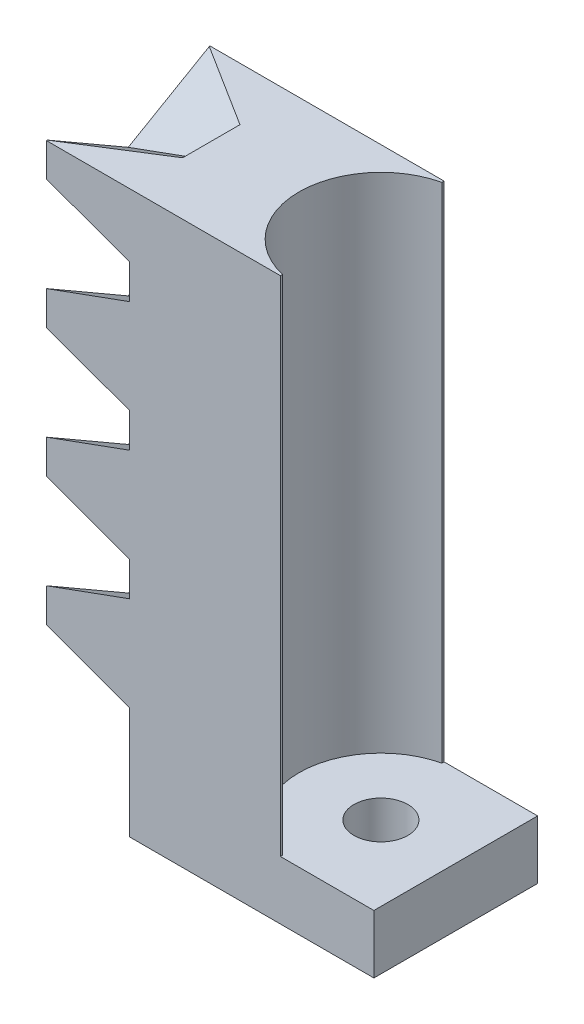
from build123d import *

# Parameters (mm, degrees)
SKETCH5_W           = 10
SKETCH5_H           = 24
BOSS_EXTRUDE2_DEPTH = 3.5
LPATTERN1_COUNT     = 5
LPATTERN1_PITCH     = 5.5
CUT_EXTRUDE1_DEPTH  = 7
SKETCH15_W          = 7
SKETCH15_H          = 2.5
BOSS_EXTRUDE3_DEPTH = 4
SKETCH16_R          = 1.15
CUT_EXTRUDE2_DEPTH  = 25.966778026
SKETCH16_3_R        = 3.5
SKETCH16_3_R_2      = 1.15
CUT_EXTRUDE3_DEPTH  = 25.966778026


with BuildPart() as part:
    # Sketch5 → Boss-Extrude2 (new, symmetric)
    with BuildSketch(Plane.XY):
        with Locations((3.2, 4.4726196)):
            Rectangle(SKETCH5_W, SKETCH5_H)
    extrude(amount=BOSS_EXTRUDE2_DEPTH, both=True)

    # Sketch9 → Cut-Loft1 section 0
    with BuildSketch(Plane.XY):
        with BuildLine():
            Line((-1.8, -7.5273804), (1.75, -6.235286))
            Line((1.75, -6.235286), (1.75, -4.7602883))
            Line((1.75, -4.7602883), (-1.8, -3.4681939))
            Line((-1.8, -3.4681939), (-1.8, -7.5273804))
        make_face()
    # Sketch11 → Cut-Loft1 section 1
    with BuildSketch(Plane(origin=(0, 2.020725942, -3.5), x_dir=(1, 0, 0), z_dir=(0, 0, 1))):
        with BuildLine():
            Line((-1.8, -7.5273804), (1.75, -6.235286))
            Line((1.75, -6.235286), (1.75, -4.7602883))
            Line((1.75, -4.7602883), (-1.8, -3.4681939))
            Line((-1.8, -3.4681939), (-1.8, -7.5273804))
        make_face()
    cut_loft1 = loft(mode=Mode.SUBTRACT)

    # Sketch9_3 → Cut-Loft2 section 0
    with BuildSketch(Plane.XY):
        with BuildLine():
            Line((-1.8, -7.5273804), (1.75, -6.235286))
            Line((1.75, -6.235286), (1.75, -4.7602883))
            Line((1.75, -4.7602883), (-1.8, -3.4681939))
            Line((-1.8, -3.4681939), (-1.8, -7.5273804))
        make_face()
    # Sketch12 → Cut-Loft2 section 1
    with BuildSketch(Plane(origin=(0, 2.020725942, 3.5), x_dir=(1, 0, 0), z_dir=(0, 0, 1))):
        with BuildLine():
            Line((-1.8, -7.5273804), (1.75, -6.235286))
            Line((1.75, -6.235286), (1.75, -4.7602883))
            Line((1.75, -4.7602883), (-1.8, -3.4681939))
            Line((-1.8, -3.4681939), (-1.8, -7.5273804))
        make_face()
    cut_loft2 = loft(mode=Mode.SUBTRACT)

    # LPattern1: Cut-Loft1, Cut-Loft2 ×5
    with Locations(*[(0, i * LPATTERN1_PITCH, 0) for i in range(1, LPATTERN1_COUNT)]):
        add(cut_loft1, mode=Mode.SUBTRACT)
        add(cut_loft2, mode=Mode.SUBTRACT)

    # Sketch14 → Cut-Extrude1 (cut)
    with BuildSketch(Plane.XY.offset(3.5)):
        Polygon((1.75, -4.214560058), (1.75, -7.5273804), (-1.8, -7.5273804), (-1.8, -5.506654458), align=None)
    extrude(amount=-CUT_EXTRUDE1_DEPTH, mode=Mode.SUBTRACT)

    # Sketch15 → Boss-Extrude3 (add)
    with BuildSketch(Plane(origin=(8.2, 0, 0), x_dir=(0, 0, -1), z_dir=(1, 0, 0))):
        with Locations((0, -6.2773804)):
            Rectangle(SKETCH15_W, SKETCH15_H)
    extrude(amount=BOSS_EXTRUDE3_DEPTH)

    # Sketch16 → Cut-Extrude2 (cut, through all)
    with BuildSketch(Plane(origin=(0, -5.0273804, 0), x_dir=(1, 0, 0), z_dir=(0, 1, 0))):
        with Locations(Location((9, 0, 0), (0, 0, 180))):
            Circle(SKETCH16_R)
    extrude(amount=-CUT_EXTRUDE2_DEPTH, mode=Mode.SUBTRACT)

    # Sketch16_3 → Cut-Extrude3 (cut, through all)
    # profile 1 of 2: a face of its own
    with BuildSketch(Plane(origin=(0, -5.0273804, 0), x_dir=(1, 0, 0), z_dir=(0, 1, 0))):
        with Locations((9, 0)):
            Circle(SKETCH16_3_R)
        with Locations(Location((9, 0, 0), (0, 0, 180))):
            Circle(SKETCH16_3_R_2, mode=Mode.SUBTRACT)
    # profile 2 of 2: a face of its own
    with BuildSketch(Plane(origin=(0, -5.0273804, 0), x_dir=(1, 0, 0), z_dir=(0, 1, 0))):
        with Locations(Location((9, 0, 0), (0, 0, 180))):
            Circle(SKETCH16_3_R_2)
    extrude(amount=CUT_EXTRUDE3_DEPTH, mode=Mode.SUBTRACT)


solid = part.part
